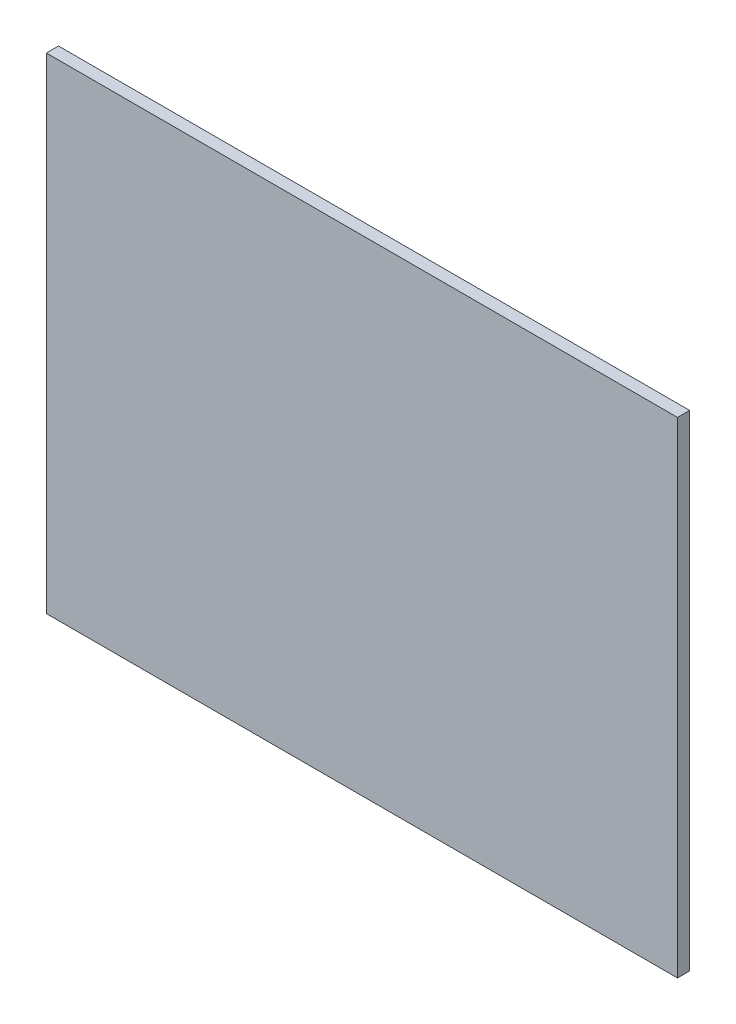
ISO-10303-21;
HEADER;
FILE_DESCRIPTION(('STEP AP214'),'2;1');
FILE_NAME('part.step','',(''),(''),'','','');
FILE_SCHEMA(('AUTOMOTIVE_DESIGN { 1 0 10303 214 1 1 1 1 }'));
ENDSEC;
DATA;
#1=APPLICATION_CONTEXT('core data for automotive mechanical design processes');
#2=APPLICATION_PROTOCOL_DEFINITION('international standard','automotive_design',2000,#1);
#3=PRODUCT_CONTEXT('',#1,'mechanical');
#4=PRODUCT('Part','Part','',(#3));
#5=PRODUCT_RELATED_PRODUCT_CATEGORY('part','',(#4));
#6=PRODUCT_DEFINITION_FORMATION('','',#4);
#7=PRODUCT_DEFINITION_CONTEXT('part definition',#1,'design');
#8=PRODUCT_DEFINITION('design','',#6,#7);
#9=PRODUCT_DEFINITION_SHAPE('','',#8);
#10=(LENGTH_UNIT() NAMED_UNIT(*) SI_UNIT(.MILLI.,.METRE.));
#11=(NAMED_UNIT(*) PLANE_ANGLE_UNIT() SI_UNIT($,.RADIAN.));
#12=(NAMED_UNIT(*) SI_UNIT($,.STERADIAN.) SOLID_ANGLE_UNIT());
#13=UNCERTAINTY_MEASURE_WITH_UNIT(LENGTH_MEASURE(1.E-05),#10,'distance_accuracy_value','');
#14=(GEOMETRIC_REPRESENTATION_CONTEXT(3) GLOBAL_UNCERTAINTY_ASSIGNED_CONTEXT((#13)) GLOBAL_UNIT_ASSIGNED_CONTEXT((#10,
#11,#12)) REPRESENTATION_CONTEXT('',''));
#15=CARTESIAN_POINT('',(0.,0.,0.));
#16=DIRECTION('',(0.,0.,1.));
#17=DIRECTION('',(1.,0.,0.));
#18=AXIS2_PLACEMENT_3D('',#15,#16,#17);
#19=CARTESIAN_POINT('',(0.,10.,0.));
#20=DIRECTION('',(0.,0.,-1.));
#21=DIRECTION('',(-1.,0.,0.));
#22=AXIS2_PLACEMENT_3D('',#19,#20,#21);
#23=PLANE('',#22);
#24=DIRECTION('',(0.,1.,0.));
#25=VECTOR('',#24,1.);
#26=CARTESIAN_POINT('',(13.,0.,0.));
#27=LINE('',#26,#25);
#28=CARTESIAN_POINT('',(13.,10.,0.));
#29=VERTEX_POINT('',#28);
#30=CARTESIAN_POINT('',(13.,0.,0.));
#31=VERTEX_POINT('',#30);
#32=EDGE_CURVE('E54',#29,#31,#27,.F.);
#33=ORIENTED_EDGE('',*,*,#32,.T.);
#34=DIRECTION('',(1.,0.,0.));
#35=VECTOR('',#34,1.);
#36=CARTESIAN_POINT('',(0.,0.,0.));
#37=LINE('',#36,#35);
#38=CARTESIAN_POINT('',(0.,0.,0.));
#39=VERTEX_POINT('',#38);
#40=EDGE_CURVE('E75',#31,#39,#37,.F.);
#41=ORIENTED_EDGE('',*,*,#40,.T.);
#42=DIRECTION('',(0.,1.,0.));
#43=VECTOR('',#42,1.);
#44=CARTESIAN_POINT('',(0.,0.,0.));
#45=LINE('',#44,#43);
#46=CARTESIAN_POINT('',(0.,10.,0.));
#47=VERTEX_POINT('',#46);
#48=EDGE_CURVE('E57',#39,#47,#45,.T.);
#49=ORIENTED_EDGE('',*,*,#48,.T.);
#50=DIRECTION('',(1.,0.,0.));
#51=VECTOR('',#50,1.);
#52=CARTESIAN_POINT('',(0.,10.,0.));
#53=LINE('',#52,#51);
#54=EDGE_CURVE('E19',#47,#29,#53,.T.);
#55=ORIENTED_EDGE('',*,*,#54,.T.);
#56=EDGE_LOOP('',(#33,#41,#49,#55));
#57=FACE_BOUND('',#56,.T.);
#58=ADVANCED_FACE('F16',(#57),#23,.T.);
#59=CARTESIAN_POINT('',(0.,10.,0.25));
#60=DIRECTION('',(0.,-1.,0.));
#61=DIRECTION('',(0.,0.,-1.));
#62=AXIS2_PLACEMENT_3D('',#59,#60,#61);
#63=PLANE('',#62);
#64=DIRECTION('',(0.,0.,-1.));
#65=VECTOR('',#64,1.);
#66=CARTESIAN_POINT('',(0.,10.,0.25));
#67=LINE('',#66,#65);
#68=CARTESIAN_POINT('',(0.,10.,0.25));
#69=VERTEX_POINT('',#68);
#70=EDGE_CURVE('E77',#47,#69,#67,.F.);
#71=ORIENTED_EDGE('',*,*,#70,.T.);
#72=DIRECTION('',(-1.,0.,0.));
#73=VECTOR('',#72,1.);
#74=CARTESIAN_POINT('',(0.,10.,0.25));
#75=LINE('',#74,#73);
#76=CARTESIAN_POINT('',(13.,10.,0.25));
#77=VERTEX_POINT('',#76);
#78=EDGE_CURVE('E72',#69,#77,#75,.F.);
#79=ORIENTED_EDGE('',*,*,#78,.T.);
#80=DIRECTION('',(0.,0.,1.));
#81=VECTOR('',#80,1.);
#82=CARTESIAN_POINT('',(13.,10.,0.25));
#83=LINE('',#82,#81);
#84=EDGE_CURVE('E62',#77,#29,#83,.F.);
#85=ORIENTED_EDGE('',*,*,#84,.T.);
#86=ORIENTED_EDGE('',*,*,#54,.F.);
#87=EDGE_LOOP('',(#71,#79,#85,#86));
#88=FACE_BOUND('',#87,.T.);
#89=ADVANCED_FACE('F71',(#88),#63,.F.);
#90=CARTESIAN_POINT('',(13.,0.,0.25));
#91=DIRECTION('',(-1.,0.,0.));
#92=DIRECTION('',(0.,0.,1.));
#93=AXIS2_PLACEMENT_3D('',#90,#91,#92);
#94=PLANE('',#93);
#95=ORIENTED_EDGE('',*,*,#84,.F.);
#96=DIRECTION('',(0.,1.,0.));
#97=VECTOR('',#96,1.);
#98=CARTESIAN_POINT('',(13.,10.,0.25));
#99=LINE('',#98,#97);
#100=CARTESIAN_POINT('',(13.,0.,0.25));
#101=VERTEX_POINT('',#100);
#102=EDGE_CURVE('E82',#77,#101,#99,.F.);
#103=ORIENTED_EDGE('',*,*,#102,.T.);
#104=DIRECTION('',(0.,0.,1.));
#105=VECTOR('',#104,1.);
#106=CARTESIAN_POINT('',(13.,0.,0.25));
#107=LINE('',#106,#105);
#108=EDGE_CURVE('E68',#101,#31,#107,.F.);
#109=ORIENTED_EDGE('',*,*,#108,.T.);
#110=ORIENTED_EDGE('',*,*,#32,.F.);
#111=EDGE_LOOP('',(#95,#103,#109,#110));
#112=FACE_BOUND('',#111,.T.);
#113=ADVANCED_FACE('F65',(#112),#94,.F.);
#114=CARTESIAN_POINT('',(0.,0.,0.25));
#115=DIRECTION('',(0.,1.,0.));
#116=DIRECTION('',(0.,0.,1.));
#117=AXIS2_PLACEMENT_3D('',#114,#115,#116);
#118=PLANE('',#117);
#119=ORIENTED_EDGE('',*,*,#108,.F.);
#120=DIRECTION('',(-1.,0.,0.));
#121=VECTOR('',#120,1.);
#122=CARTESIAN_POINT('',(0.,0.,0.25));
#123=LINE('',#122,#121);
#124=CARTESIAN_POINT('',(0.,0.,0.25));
#125=VERTEX_POINT('',#124);
#126=EDGE_CURVE('E25',#101,#125,#123,.T.);
#127=ORIENTED_EDGE('',*,*,#126,.T.);
#128=DIRECTION('',(0.,0.,-1.));
#129=VECTOR('',#128,1.);
#130=CARTESIAN_POINT('',(0.,0.,0.25));
#131=LINE('',#130,#129);
#132=EDGE_CURVE('E33',#125,#39,#131,.T.);
#133=ORIENTED_EDGE('',*,*,#132,.T.);
#134=ORIENTED_EDGE('',*,*,#40,.F.);
#135=EDGE_LOOP('',(#119,#127,#133,#134));
#136=FACE_BOUND('',#135,.T.);
#137=ADVANCED_FACE('F87',(#136),#118,.F.);
#138=CARTESIAN_POINT('',(0.,0.,0.25));
#139=DIRECTION('',(1.,0.,0.));
#140=DIRECTION('',(0.,0.,-1.));
#141=AXIS2_PLACEMENT_3D('',#138,#139,#140);
#142=PLANE('',#141);
#143=ORIENTED_EDGE('',*,*,#132,.F.);
#144=DIRECTION('',(0.,1.,0.));
#145=VECTOR('',#144,1.);
#146=CARTESIAN_POINT('',(0.,10.,0.25));
#147=LINE('',#146,#145);
#148=EDGE_CURVE('E11',#125,#69,#147,.T.);
#149=ORIENTED_EDGE('',*,*,#148,.T.);
#150=ORIENTED_EDGE('',*,*,#70,.F.);
#151=ORIENTED_EDGE('',*,*,#48,.F.);
#152=EDGE_LOOP('',(#143,#149,#150,#151));
#153=FACE_BOUND('',#152,.T.);
#154=ADVANCED_FACE('F90',(#153),#142,.F.);
#155=CARTESIAN_POINT('',(0.,10.,0.25));
#156=DIRECTION('',(0.,0.,-1.));
#157=DIRECTION('',(-1.,0.,0.));
#158=AXIS2_PLACEMENT_3D('',#155,#156,#157);
#159=PLANE('',#158);
#160=ORIENTED_EDGE('',*,*,#126,.F.);
#161=ORIENTED_EDGE('',*,*,#102,.F.);
#162=ORIENTED_EDGE('',*,*,#78,.F.);
#163=ORIENTED_EDGE('',*,*,#148,.F.);
#164=EDGE_LOOP('',(#160,#161,#162,#163));
#165=FACE_BOUND('',#164,.T.);
#166=ADVANCED_FACE('F89',(#165),#159,.F.);
#167=CLOSED_SHELL('',(#58,#89,#113,#137,#154,#166));
#168=MANIFOLD_SOLID_BREP('B1',#167);
#169=ADVANCED_BREP_SHAPE_REPRESENTATION('',(#18,#168),#14);
#170=SHAPE_DEFINITION_REPRESENTATION(#9,#169);
ENDSEC;
END-ISO-10303-21;
